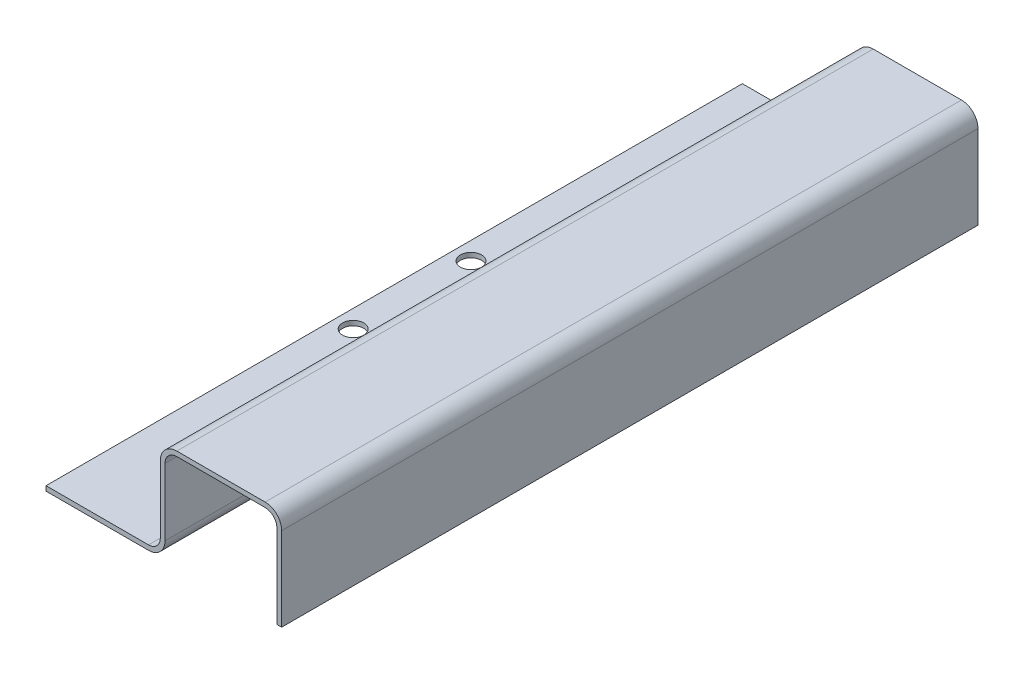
from build123d import *

# Parameters (mm, degrees)
EXTRUDE1_DEPTH             = 75.057
F_15_0_18_DIAMETER_HOLE1_D = 4.572


with BuildPart() as part:
    # Sketch6 → Extrude1 (new, symmetric)
    with BuildSketch(Plane.XY):
        with BuildLine():
            Line((49.77638, -1.02362), (50.8, -1.02362))
            Line((50.8, -1.02362), (50.8, 17.00276))
            ThreePointArc((50.8, 17.00276), (49.756239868, 19.522619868), (47.23638, 20.56638))
            Line((47.23638, 20.56638), (28.20162, 20.56638))
            ThreePointArc((28.20162, 20.56638), (25.681760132, 19.522619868), (24.638, 17.00276))
            Line((24.638, 17.00276), (24.638, 2.54))
            ThreePointArc((24.638, 2.54), (23.894051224, 0.743948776), (22.098, 0))
            Line((22.098, 0), (0, 0))
            Line((0, 0), (0, -1.02362))
            Line((0, -1.02362), (22.098, -1.02362))
            ThreePointArc((22.098, -1.02362), (24.617859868, 0.020140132), (25.66162, 2.54))
            Line((25.66162, 2.54), (25.66162, 17.00276))
            ThreePointArc((25.66162, 17.00276), (26.405568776, 18.798811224), (28.20162, 19.54276))
            Line((28.20162, 19.54276), (47.23638, 19.54276))
            ThreePointArc((47.23638, 19.54276), (49.032431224, 18.798811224), (49.77638, 17.00276))
            Line((49.77638, 17.00276), (49.77638, -1.02362))
        make_face()
    extrude(amount=EXTRUDE1_DEPTH, both=True)

    # 15 _0.18_ Diameter Hole1 (through all)
    with Locations(Plane(origin=(-3.596105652, 0, -112.383727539), x_dir=(-1, 0, 0), z_dir=(0, 1, 0))):
        with Locations((-7.456905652, 125.083727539), (-7.456905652, 99.683727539)):
            Hole(F_15_0_18_DIAMETER_HOLE1_D / 2)


solid = part.part
